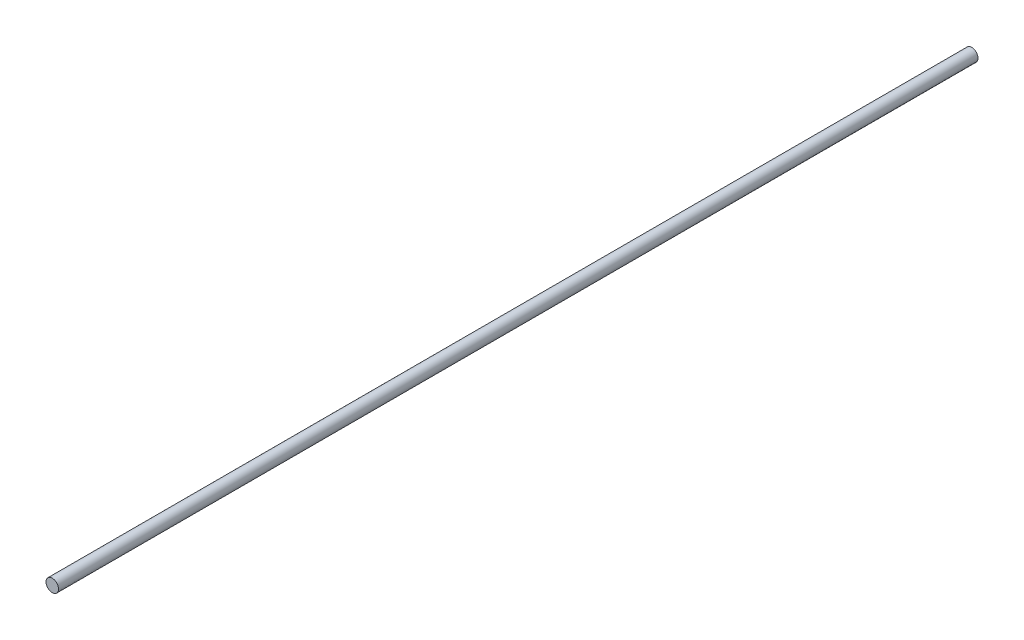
ISO-10303-21;
HEADER;
FILE_DESCRIPTION(('STEP AP214'),'2;1');
FILE_NAME('part.step','',(''),(''),'','','');
FILE_SCHEMA(('AUTOMOTIVE_DESIGN { 1 0 10303 214 1 1 1 1 }'));
ENDSEC;
DATA;
#1=APPLICATION_CONTEXT('core data for automotive mechanical design processes');
#2=APPLICATION_PROTOCOL_DEFINITION('international standard','automotive_design',2000,#1);
#3=PRODUCT_CONTEXT('',#1,'mechanical');
#4=PRODUCT('Part','Part','',(#3));
#5=PRODUCT_RELATED_PRODUCT_CATEGORY('part','',(#4));
#6=PRODUCT_DEFINITION_FORMATION('','',#4);
#7=PRODUCT_DEFINITION_CONTEXT('part definition',#1,'design');
#8=PRODUCT_DEFINITION('design','',#6,#7);
#9=PRODUCT_DEFINITION_SHAPE('','',#8);
#10=(LENGTH_UNIT() NAMED_UNIT(*) SI_UNIT(.MILLI.,.METRE.));
#11=(NAMED_UNIT(*) PLANE_ANGLE_UNIT() SI_UNIT($,.RADIAN.));
#12=(NAMED_UNIT(*) SI_UNIT($,.STERADIAN.) SOLID_ANGLE_UNIT());
#13=UNCERTAINTY_MEASURE_WITH_UNIT(LENGTH_MEASURE(1.E-05),#10,'distance_accuracy_value','');
#14=(GEOMETRIC_REPRESENTATION_CONTEXT(3) GLOBAL_UNCERTAINTY_ASSIGNED_CONTEXT((#13)) GLOBAL_UNIT_ASSIGNED_CONTEXT((#10,
#11,#12)) REPRESENTATION_CONTEXT('',''));
#15=CARTESIAN_POINT('',(0.,0.,0.));
#16=DIRECTION('',(0.,0.,1.));
#17=DIRECTION('',(1.,0.,0.));
#18=AXIS2_PLACEMENT_3D('',#15,#16,#17);
#19=CARTESIAN_POINT('',(0.,0.,-4400.));
#20=DIRECTION('',(0.,0.,1.));
#21=DIRECTION('',(1.,0.,0.));
#22=AXIS2_PLACEMENT_3D('',#19,#20,#21);
#23=CYLINDRICAL_SURFACE('',#22,30.);
#24=CARTESIAN_POINT('',(0.,0.,-4400.));
#25=DIRECTION('',(0.,0.,1.));
#26=DIRECTION('',(1.,0.,0.));
#27=AXIS2_PLACEMENT_3D('',#24,#25,#26);
#28=CIRCLE('',#27,30.);
#29=CARTESIAN_POINT('',(30.,0.,-4400.));
#30=VERTEX_POINT('',#29);
#31=EDGE_CURVE('E10',#30,#30,#28,.T.);
#32=ORIENTED_EDGE('',*,*,#31,.T.);
#33=EDGE_LOOP('',(#32));
#34=FACE_BOUND('',#33,.T.);
#35=CARTESIAN_POINT('',(0.,0.,0.));
#36=DIRECTION('',(0.,0.,1.));
#37=DIRECTION('',(1.,0.,0.));
#38=AXIS2_PLACEMENT_3D('',#35,#36,#37);
#39=CIRCLE('',#38,30.);
#40=CARTESIAN_POINT('',(30.,0.,0.));
#41=VERTEX_POINT('',#40);
#42=EDGE_CURVE('E40',#41,#41,#39,.T.);
#43=ORIENTED_EDGE('',*,*,#42,.F.);
#44=EDGE_LOOP('',(#43));
#45=FACE_BOUND('',#44,.T.);
#46=ADVANCED_FACE('F37',(#34,#45),#23,.T.);
#47=CARTESIAN_POINT('',(0.,0.,-4400.));
#48=DIRECTION('',(0.,0.,1.));
#49=DIRECTION('',(1.,0.,0.));
#50=AXIS2_PLACEMENT_3D('',#47,#48,#49);
#51=PLANE('',#50);
#52=ORIENTED_EDGE('',*,*,#31,.F.);
#53=EDGE_LOOP('',(#52));
#54=FACE_BOUND('',#53,.T.);
#55=ADVANCED_FACE('F54',(#54),#51,.F.);
#56=CARTESIAN_POINT('',(0.,0.,0.));
#57=DIRECTION('',(0.,0.,1.));
#58=DIRECTION('',(1.,0.,0.));
#59=AXIS2_PLACEMENT_3D('',#56,#57,#58);
#60=PLANE('',#59);
#61=ORIENTED_EDGE('',*,*,#42,.T.);
#62=EDGE_LOOP('',(#61));
#63=FACE_BOUND('',#62,.T.);
#64=ADVANCED_FACE('F51',(#63),#60,.T.);
#65=CLOSED_SHELL('',(#46,#55,#64));
#66=MANIFOLD_SOLID_BREP('B2',#65);
#67=ADVANCED_BREP_SHAPE_REPRESENTATION('',(#18,#66),#14);
#68=SHAPE_DEFINITION_REPRESENTATION(#9,#67);
ENDSEC;
END-ISO-10303-21;
